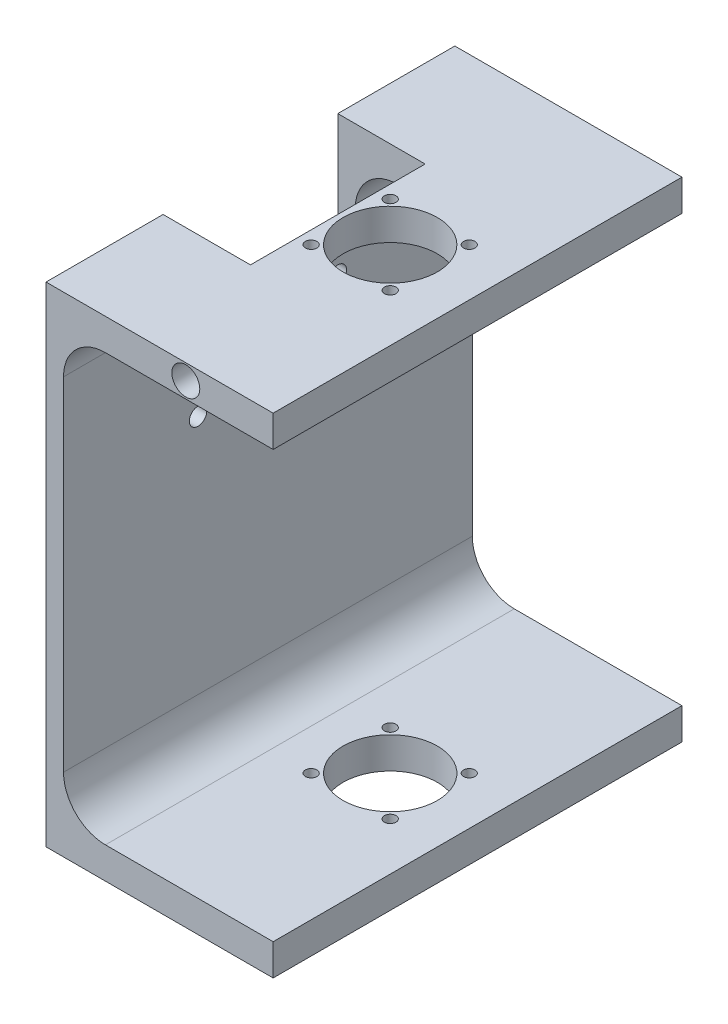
ISO-10303-21;
HEADER;
FILE_DESCRIPTION(('STEP AP214'),'2;1');
FILE_NAME('part.step','',(''),(''),'','','');
FILE_SCHEMA(('AUTOMOTIVE_DESIGN { 1 0 10303 214 1 1 1 1 }'));
ENDSEC;
DATA;
#1=APPLICATION_CONTEXT('core data for automotive mechanical design processes');
#2=APPLICATION_PROTOCOL_DEFINITION('international standard','automotive_design',2000,#1);
#3=PRODUCT_CONTEXT('',#1,'mechanical');
#4=PRODUCT('Part','Part','',(#3));
#5=PRODUCT_RELATED_PRODUCT_CATEGORY('part','',(#4));
#6=PRODUCT_DEFINITION_FORMATION('','',#4);
#7=PRODUCT_DEFINITION_CONTEXT('part definition',#1,'design');
#8=PRODUCT_DEFINITION('design','',#6,#7);
#9=PRODUCT_DEFINITION_SHAPE('','',#8);
#10=(LENGTH_UNIT() NAMED_UNIT(*) SI_UNIT(.MILLI.,.METRE.));
#11=(NAMED_UNIT(*) PLANE_ANGLE_UNIT() SI_UNIT($,.RADIAN.));
#12=(NAMED_UNIT(*) SI_UNIT($,.STERADIAN.) SOLID_ANGLE_UNIT());
#13=UNCERTAINTY_MEASURE_WITH_UNIT(LENGTH_MEASURE(1.E-05),#10,'distance_accuracy_value','');
#14=(GEOMETRIC_REPRESENTATION_CONTEXT(3) GLOBAL_UNCERTAINTY_ASSIGNED_CONTEXT((#13)) GLOBAL_UNIT_ASSIGNED_CONTEXT((#10,
#11,#12)) REPRESENTATION_CONTEXT('',''));
#15=CARTESIAN_POINT('',(0.,0.,0.));
#16=DIRECTION('',(0.,0.,1.));
#17=DIRECTION('',(1.,0.,0.));
#18=AXIS2_PLACEMENT_3D('',#15,#16,#17);
#19=CARTESIAN_POINT('',(17.,48.9999999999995,58.5));
#20=DIRECTION('',(0.,0.,1.));
#21=DIRECTION('',(1.,0.,0.));
#22=AXIS2_PLACEMENT_3D('',#19,#20,#21);
#23=CYLINDRICAL_SURFACE('',#22,12.);
#24=DIRECTION('',(0.,0.,-1.));
#25=VECTOR('',#24,1.);
#26=CARTESIAN_POINT('',(5.00000000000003,49.,58.5));
#27=LINE('',#26,#25);
#28=CARTESIAN_POINT('',(5.,49.,25.));
#29=VERTEX_POINT('',#28);
#30=CARTESIAN_POINT('',(5.00000000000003,49.,58.5));
#31=VERTEX_POINT('',#30);
#32=EDGE_CURVE('E321',#29,#31,#27,.F.);
#33=ORIENTED_EDGE('',*,*,#32,.F.);
#34=CARTESIAN_POINT('',(17.,49.,25.));
#35=DIRECTION('',(0.,0.,1.));
#36=DIRECTION('',(1.,0.,0.));
#37=AXIS2_PLACEMENT_3D('',#34,#35,#36);
#38=CIRCLE('',#37,12.);
#39=CARTESIAN_POINT('',(17.,61.,25.));
#40=VERTEX_POINT('',#39);
#41=EDGE_CURVE('E346',#29,#40,#38,.F.);
#42=ORIENTED_EDGE('',*,*,#41,.T.);
#43=DIRECTION('',(0.,0.,-1.));
#44=VECTOR('',#43,1.);
#45=CARTESIAN_POINT('',(17.,61.,-58.5));
#46=LINE('',#45,#44);
#47=CARTESIAN_POINT('',(17.,61.,58.5));
#48=VERTEX_POINT('',#47);
#49=EDGE_CURVE('E331',#48,#40,#46,.T.);
#50=ORIENTED_EDGE('',*,*,#49,.F.);
#51=CARTESIAN_POINT('',(17.,48.9999999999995,58.5));
#52=DIRECTION('',(0.,0.,-1.));
#53=DIRECTION('',(-1.,0.,0.));
#54=AXIS2_PLACEMENT_3D('',#51,#52,#53);
#55=CIRCLE('',#54,12.);
#56=EDGE_CURVE('E340',#31,#48,#55,.T.);
#57=ORIENTED_EDGE('',*,*,#56,.F.);
#58=EDGE_LOOP('',(#33,#42,#50,#57));
#59=FACE_BOUND('',#58,.T.);
#60=ADVANCED_FACE('F26',(#59),#23,.F.);
#61=CARTESIAN_POINT('',(65.,70.,58.5));
#62=DIRECTION('',(-1.,0.,0.));
#63=DIRECTION('',(0.,0.,1.));
#64=AXIS2_PLACEMENT_3D('',#61,#62,#63);
#65=PLANE('',#64);
#66=DIRECTION('',(0.,1.,0.));
#67=VECTOR('',#66,1.);
#68=CARTESIAN_POINT('',(65.0000000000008,69.9999999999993,-58.5));
#69=LINE('',#68,#67);
#70=CARTESIAN_POINT('',(65.,61.,-58.5));
#71=VERTEX_POINT('',#70);
#72=CARTESIAN_POINT('',(65.0000000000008,69.9999999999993,-58.5));
#73=VERTEX_POINT('',#72);
#74=EDGE_CURVE('E263',#71,#73,#69,.T.);
#75=ORIENTED_EDGE('',*,*,#74,.T.);
#76=DIRECTION('',(0.,0.,-1.));
#77=VECTOR('',#76,1.);
#78=CARTESIAN_POINT('',(65.,70.,58.5));
#79=LINE('',#78,#77);
#80=CARTESIAN_POINT('',(65.,70.,58.5));
#81=VERTEX_POINT('',#80);
#82=EDGE_CURVE('E318',#81,#73,#79,.T.);
#83=ORIENTED_EDGE('',*,*,#82,.F.);
#84=DIRECTION('',(0.,1.,0.));
#85=VECTOR('',#84,1.);
#86=CARTESIAN_POINT('',(65.,70.,58.5));
#87=LINE('',#86,#85);
#88=CARTESIAN_POINT('',(65.,61.,58.5));
#89=VERTEX_POINT('',#88);
#90=EDGE_CURVE('E283',#89,#81,#87,.T.);
#91=ORIENTED_EDGE('',*,*,#90,.F.);
#92=DIRECTION('',(0.,0.,-1.));
#93=VECTOR('',#92,1.);
#94=CARTESIAN_POINT('',(65.,61.,58.5));
#95=LINE('',#94,#93);
#96=EDGE_CURVE('E302',#89,#71,#95,.T.);
#97=ORIENTED_EDGE('',*,*,#96,.T.);
#98=EDGE_LOOP('',(#75,#83,#91,#97));
#99=FACE_BOUND('',#98,.T.);
#100=ADVANCED_FACE('F28',(#99),#65,.F.);
#101=CARTESIAN_POINT('',(65.,70.,58.5));
#102=DIRECTION('',(0.,-1.,0.));
#103=DIRECTION('',(0.,0.,-1.));
#104=AXIS2_PLACEMENT_3D('',#101,#102,#103);
#105=PLANE('',#104);
#106=CARTESIAN_POINT('',(51.3137084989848,70.0000000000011,11.3137084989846));
#107=DIRECTION('',(0.,-1.,0.));
#108=DIRECTION('',(0.,0.,-1.));
#109=AXIS2_PLACEMENT_3D('',#106,#107,#108);
#110=CIRCLE('',#109,1.64999999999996);
#111=CARTESIAN_POINT('',(51.3137084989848,70.0000000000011,9.66370849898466));
#112=VERTEX_POINT('',#111);
#113=EDGE_CURVE('E178',#112,#112,#110,.T.);
#114=ORIENTED_EDGE('',*,*,#113,.T.);
#115=EDGE_LOOP('',(#114));
#116=FACE_BOUND('',#115,.T.);
#117=CARTESIAN_POINT('',(51.3137084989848,70.,-11.3137084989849));
#118=DIRECTION('',(0.,-1.,0.));
#119=DIRECTION('',(0.,0.,-1.));
#120=AXIS2_PLACEMENT_3D('',#117,#118,#119);
#121=CIRCLE('',#120,1.64999999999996);
#122=CARTESIAN_POINT('',(51.3137084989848,70.,-12.9637084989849));
#123=VERTEX_POINT('',#122);
#124=EDGE_CURVE('E188',#123,#123,#121,.T.);
#125=ORIENTED_EDGE('',*,*,#124,.T.);
#126=EDGE_LOOP('',(#125));
#127=FACE_BOUND('',#126,.T.);
#128=CARTESIAN_POINT('',(28.6862915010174,69.9999999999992,-11.3137084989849));
#129=DIRECTION('',(0.,-1.,0.));
#130=DIRECTION('',(0.,0.,-1.));
#131=AXIS2_PLACEMENT_3D('',#128,#129,#130);
#132=CIRCLE('',#131,1.64999999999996);
#133=CARTESIAN_POINT('',(28.6862915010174,69.9999999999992,-12.9637084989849));
#134=VERTEX_POINT('',#133);
#135=EDGE_CURVE('E198',#134,#134,#132,.T.);
#136=ORIENTED_EDGE('',*,*,#135,.T.);
#137=EDGE_LOOP('',(#136));
#138=FACE_BOUND('',#137,.T.);
#139=CARTESIAN_POINT('',(28.6862915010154,70.0000000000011,11.3137084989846));
#140=DIRECTION('',(0.,-1.,0.));
#141=DIRECTION('',(0.,0.,-1.));
#142=AXIS2_PLACEMENT_3D('',#139,#140,#141);
#143=CIRCLE('',#142,1.64999999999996);
#144=CARTESIAN_POINT('',(28.6862915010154,70.0000000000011,9.66370849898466));
#145=VERTEX_POINT('',#144);
#146=EDGE_CURVE('E208',#145,#145,#143,.T.);
#147=ORIENTED_EDGE('',*,*,#146,.T.);
#148=EDGE_LOOP('',(#147));
#149=FACE_BOUND('',#148,.T.);
#150=CARTESIAN_POINT('',(40.,70.,0.));
#151=DIRECTION('',(0.,1.,0.));
#152=DIRECTION('',(-1.,0.,0.));
#153=AXIS2_PLACEMENT_3D('',#150,#151,#152);
#154=CIRCLE('',#153,13.5);
#155=CARTESIAN_POINT('',(26.5,70.,0.));
#156=VERTEX_POINT('',#155);
#157=EDGE_CURVE('E253',#156,#156,#154,.T.);
#158=ORIENTED_EDGE('',*,*,#157,.F.);
#159=EDGE_LOOP('',(#158));
#160=FACE_BOUND('',#159,.T.);
#161=DIRECTION('',(0.,0.,-1.));
#162=VECTOR('',#161,1.);
#163=CARTESIAN_POINT('',(25.,70.,-25.));
#164=LINE('',#163,#162);
#165=CARTESIAN_POINT('',(25.,69.9999999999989,25.));
#166=VERTEX_POINT('',#165);
#167=CARTESIAN_POINT('',(25.,70.,-25.));
#168=VERTEX_POINT('',#167);
#169=EDGE_CURVE('E218',#166,#168,#164,.T.);
#170=ORIENTED_EDGE('',*,*,#169,.F.);
#171=DIRECTION('',(1.,0.,0.));
#172=VECTOR('',#171,1.);
#173=CARTESIAN_POINT('',(25.,69.9999999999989,25.));
#174=LINE('',#173,#172);
#175=CARTESIAN_POINT('',(0.,69.9999999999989,25.));
#176=VERTEX_POINT('',#175);
#177=EDGE_CURVE('E223',#176,#166,#174,.T.);
#178=ORIENTED_EDGE('',*,*,#177,.F.);
#179=DIRECTION('',(0.,0.,-1.));
#180=VECTOR('',#179,1.);
#181=CARTESIAN_POINT('',(0.,70.,58.5));
#182=LINE('',#181,#180);
#183=CARTESIAN_POINT('',(0.,70.,58.5));
#184=VERTEX_POINT('',#183);
#185=EDGE_CURVE('E315',#184,#176,#182,.T.);
#186=ORIENTED_EDGE('',*,*,#185,.F.);
#187=DIRECTION('',(-1.,0.,0.));
#188=VECTOR('',#187,1.);
#189=CARTESIAN_POINT('',(65.,70.,58.5));
#190=LINE('',#189,#188);
#191=EDGE_CURVE('E286',#81,#184,#190,.T.);
#192=ORIENTED_EDGE('',*,*,#191,.F.);
#193=ORIENTED_EDGE('',*,*,#82,.T.);
#194=DIRECTION('',(-1.,0.,0.));
#195=VECTOR('',#194,1.);
#196=CARTESIAN_POINT('',(65.0000000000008,69.9999999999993,-58.5));
#197=LINE('',#196,#195);
#198=CARTESIAN_POINT('',(0.,69.9999999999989,-58.5));
#199=VERTEX_POINT('',#198);
#200=EDGE_CURVE('E266',#73,#199,#197,.T.);
#201=ORIENTED_EDGE('',*,*,#200,.T.);
#202=CARTESIAN_POINT('',(0.,70.,-25.));
#203=VERTEX_POINT('',#202);
#204=EDGE_CURVE('E314',#203,#199,#182,.T.);
#205=ORIENTED_EDGE('',*,*,#204,.F.);
#206=DIRECTION('',(-1.,0.,0.));
#207=VECTOR('',#206,1.);
#208=CARTESIAN_POINT('',(25.,70.,-25.));
#209=LINE('',#208,#207);
#210=EDGE_CURVE('E221',#168,#203,#209,.T.);
#211=ORIENTED_EDGE('',*,*,#210,.F.);
#212=EDGE_LOOP('',(#170,#178,#186,#192,#193,#201,#205,#211));
#213=FACE_BOUND('',#212,.T.);
#214=ADVANCED_FACE('F385',(#116,#127,#138,#149,#160,#213),#105,.F.);
#215=CARTESIAN_POINT('',(0.,70.,58.5));
#216=DIRECTION('',(1.,0.,0.));
#217=DIRECTION('',(0.,0.,-1.));
#218=AXIS2_PLACEMENT_3D('',#215,#216,#217);
#219=PLANE('',#218);
#220=CARTESIAN_POINT('',(0.,20.,-19.9999999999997));
#221=DIRECTION('',(-1.,0.,0.));
#222=DIRECTION('',(0.,0.,1.));
#223=AXIS2_PLACEMENT_3D('',#220,#221,#222);
#224=CIRCLE('',#223,2.5);
#225=CARTESIAN_POINT('',(0.,20.,-17.4999999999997));
#226=VERTEX_POINT('',#225);
#227=EDGE_CURVE('E373',#226,#226,#224,.T.);
#228=ORIENTED_EDGE('',*,*,#227,.F.);
#229=EDGE_LOOP('',(#228));
#230=FACE_BOUND('',#229,.T.);
#231=CARTESIAN_POINT('',(0.,35.,-20.));
#232=DIRECTION('',(-1.,0.,0.));
#233=DIRECTION('',(0.,0.,1.));
#234=AXIS2_PLACEMENT_3D('',#231,#232,#233);
#235=CIRCLE('',#234,2.5);
#236=CARTESIAN_POINT('',(0.,35.,-17.5));
#237=VERTEX_POINT('',#236);
#238=EDGE_CURVE('E364',#237,#237,#235,.T.);
#239=ORIENTED_EDGE('',*,*,#238,.F.);
#240=EDGE_LOOP('',(#239));
#241=FACE_BOUND('',#240,.T.);
#242=CARTESIAN_POINT('',(0.,35.,20.));
#243=DIRECTION('',(-1.,0.,0.));
#244=DIRECTION('',(0.,0.,1.));
#245=AXIS2_PLACEMENT_3D('',#242,#243,#244);
#246=CIRCLE('',#245,2.5);
#247=CARTESIAN_POINT('',(0.,35.,22.5));
#248=VERTEX_POINT('',#247);
#249=EDGE_CURVE('E361',#248,#248,#246,.T.);
#250=ORIENTED_EDGE('',*,*,#249,.F.);
#251=EDGE_LOOP('',(#250));
#252=FACE_BOUND('',#251,.T.);
#253=CARTESIAN_POINT('',(0.,20.,20.0000000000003));
#254=DIRECTION('',(-1.,0.,0.));
#255=DIRECTION('',(0.,0.,1.));
#256=AXIS2_PLACEMENT_3D('',#253,#254,#255);
#257=CIRCLE('',#256,2.5);
#258=CARTESIAN_POINT('',(0.,20.,22.5000000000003));
#259=VERTEX_POINT('',#258);
#260=EDGE_CURVE('E168',#259,#259,#257,.T.);
#261=ORIENTED_EDGE('',*,*,#260,.F.);
#262=EDGE_LOOP('',(#261));
#263=FACE_BOUND('',#262,.T.);
#264=ORIENTED_EDGE('',*,*,#185,.T.);
#265=DIRECTION('',(0.,-1.,0.));
#266=VECTOR('',#265,1.);
#267=CARTESIAN_POINT('',(0.,69.9999999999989,25.));
#268=LINE('',#267,#266);
#269=CARTESIAN_POINT('',(0.,40.,25.0000000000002));
#270=VERTEX_POINT('',#269);
#271=EDGE_CURVE('E247',#176,#270,#268,.T.);
#272=ORIENTED_EDGE('',*,*,#271,.T.);
#273=DIRECTION('',(0.,0.,-1.));
#274=VECTOR('',#273,1.);
#275=CARTESIAN_POINT('',(0.,39.9999999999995,58.5));
#276=LINE('',#275,#274);
#277=CARTESIAN_POINT('',(0.,40.,-24.9999999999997));
#278=VERTEX_POINT('',#277);
#279=EDGE_CURVE('E250',#270,#278,#276,.T.);
#280=ORIENTED_EDGE('',*,*,#279,.T.);
#281=DIRECTION('',(0.,1.,0.));
#282=VECTOR('',#281,1.);
#283=CARTESIAN_POINT('',(0.,70.,-25.));
#284=LINE('',#283,#282);
#285=EDGE_CURVE('E238',#278,#203,#284,.T.);
#286=ORIENTED_EDGE('',*,*,#285,.T.);
#287=ORIENTED_EDGE('',*,*,#204,.T.);
#288=DIRECTION('',(0.,-1.,0.));
#289=VECTOR('',#288,1.);
#290=CARTESIAN_POINT('',(0.,69.9999999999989,-58.5));
#291=LINE('',#290,#289);
#292=CARTESIAN_POINT('',(0.,-70.,-58.5));
#293=VERTEX_POINT('',#292);
#294=EDGE_CURVE('E269',#199,#293,#291,.T.);
#295=ORIENTED_EDGE('',*,*,#294,.T.);
#296=DIRECTION('',(0.,0.,-1.));
#297=VECTOR('',#296,1.);
#298=CARTESIAN_POINT('',(0.,-70.,58.5));
#299=LINE('',#298,#297);
#300=CARTESIAN_POINT('',(0.,-70.,58.5));
#301=VERTEX_POINT('',#300);
#302=EDGE_CURVE('E311',#301,#293,#299,.T.);
#303=ORIENTED_EDGE('',*,*,#302,.F.);
#304=DIRECTION('',(0.,-1.,0.));
#305=VECTOR('',#304,1.);
#306=CARTESIAN_POINT('',(0.,70.,58.5));
#307=LINE('',#306,#305);
#308=EDGE_CURVE('E288',#184,#301,#307,.T.);
#309=ORIENTED_EDGE('',*,*,#308,.F.);
#310=EDGE_LOOP('',(#264,#272,#280,#286,#287,#295,#303,#309));
#311=FACE_BOUND('',#310,.T.);
#312=ADVANCED_FACE('F381',(#230,#241,#252,#263,#311),#219,.F.);
#313=CARTESIAN_POINT('',(65.,-70.,58.5));
#314=DIRECTION('',(0.,1.,0.));
#315=DIRECTION('',(0.,0.,1.));
#316=AXIS2_PLACEMENT_3D('',#313,#314,#315);
#317=PLANE('',#316);
#318=CARTESIAN_POINT('',(51.3137084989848,-70.,11.3137084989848));
#319=DIRECTION('',(0.,-1.,0.));
#320=DIRECTION('',(0.,0.,-1.));
#321=AXIS2_PLACEMENT_3D('',#318,#319,#320);
#322=CIRCLE('',#321,1.64999999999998);
#323=CARTESIAN_POINT('',(51.3137084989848,-70.,9.66370849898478));
#324=VERTEX_POINT('',#323);
#325=EDGE_CURVE('E181',#324,#324,#322,.T.);
#326=ORIENTED_EDGE('',*,*,#325,.F.);
#327=EDGE_LOOP('',(#326));
#328=FACE_BOUND('',#327,.T.);
#329=CARTESIAN_POINT('',(51.3137084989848,-70.,-11.3137084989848));
#330=DIRECTION('',(0.,-1.,0.));
#331=DIRECTION('',(0.,0.,-1.));
#332=AXIS2_PLACEMENT_3D('',#329,#330,#331);
#333=CIRCLE('',#332,1.64999999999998);
#334=CARTESIAN_POINT('',(51.3137084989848,-70.,-12.9637084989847));
#335=VERTEX_POINT('',#334);
#336=EDGE_CURVE('E191',#335,#335,#333,.T.);
#337=ORIENTED_EDGE('',*,*,#336,.F.);
#338=EDGE_LOOP('',(#337));
#339=FACE_BOUND('',#338,.T.);
#340=CARTESIAN_POINT('',(28.6862915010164,-69.9999999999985,-11.3137084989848));
#341=DIRECTION('',(0.,-1.,0.));
#342=DIRECTION('',(0.,0.,-1.));
#343=AXIS2_PLACEMENT_3D('',#340,#341,#342);
#344=CIRCLE('',#343,1.64999999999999);
#345=CARTESIAN_POINT('',(28.6862915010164,-69.9999999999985,-12.9637084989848));
#346=VERTEX_POINT('',#345);
#347=EDGE_CURVE('E201',#346,#346,#344,.T.);
#348=ORIENTED_EDGE('',*,*,#347,.F.);
#349=EDGE_LOOP('',(#348));
#350=FACE_BOUND('',#349,.T.);
#351=CARTESIAN_POINT('',(28.6862915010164,-69.9999999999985,11.3137084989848));
#352=DIRECTION('',(0.,-1.,0.));
#353=DIRECTION('',(0.,0.,-1.));
#354=AXIS2_PLACEMENT_3D('',#351,#352,#353);
#355=CIRCLE('',#354,1.64999999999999);
#356=CARTESIAN_POINT('',(28.6862915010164,-69.9999999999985,9.66370849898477));
#357=VERTEX_POINT('',#356);
#358=EDGE_CURVE('E211',#357,#357,#355,.T.);
#359=ORIENTED_EDGE('',*,*,#358,.F.);
#360=EDGE_LOOP('',(#359));
#361=FACE_BOUND('',#360,.T.);
#362=CARTESIAN_POINT('',(40.,-70.,0.));
#363=DIRECTION('',(0.,1.,0.));
#364=DIRECTION('',(-1.,0.,0.));
#365=AXIS2_PLACEMENT_3D('',#362,#363,#364);
#366=CIRCLE('',#365,13.5);
#367=CARTESIAN_POINT('',(26.5,-70.,0.));
#368=VERTEX_POINT('',#367);
#369=EDGE_CURVE('E256',#368,#368,#366,.T.);
#370=ORIENTED_EDGE('',*,*,#369,.T.);
#371=EDGE_LOOP('',(#370));
#372=FACE_BOUND('',#371,.T.);
#373=DIRECTION('',(1.,0.,0.));
#374=VECTOR('',#373,1.);
#375=CARTESIAN_POINT('',(65.,-70.,-58.5));
#376=LINE('',#375,#374);
#377=CARTESIAN_POINT('',(65.,-70.,-58.5));
#378=VERTEX_POINT('',#377);
#379=EDGE_CURVE('E271',#293,#378,#376,.T.);
#380=ORIENTED_EDGE('',*,*,#379,.T.);
#381=DIRECTION('',(0.,0.,-1.));
#382=VECTOR('',#381,1.);
#383=CARTESIAN_POINT('',(65.,-70.,58.5));
#384=LINE('',#383,#382);
#385=CARTESIAN_POINT('',(65.,-70.,58.5));
#386=VERTEX_POINT('',#385);
#387=EDGE_CURVE('E308',#386,#378,#384,.T.);
#388=ORIENTED_EDGE('',*,*,#387,.F.);
#389=DIRECTION('',(1.,0.,0.));
#390=VECTOR('',#389,1.);
#391=CARTESIAN_POINT('',(65.,-70.,58.5));
#392=LINE('',#391,#390);
#393=EDGE_CURVE('E290',#301,#386,#392,.T.);
#394=ORIENTED_EDGE('',*,*,#393,.F.);
#395=ORIENTED_EDGE('',*,*,#302,.T.);
#396=EDGE_LOOP('',(#380,#388,#394,#395));
#397=FACE_BOUND('',#396,.T.);
#398=ADVANCED_FACE('F384',(#328,#339,#350,#361,#372,#397),#317,.F.);
#399=CARTESIAN_POINT('',(65.,-61.,58.5));
#400=DIRECTION('',(-1.,0.,0.));
#401=DIRECTION('',(0.,0.,1.));
#402=AXIS2_PLACEMENT_3D('',#399,#400,#401);
#403=PLANE('',#402);
#404=DIRECTION('',(0.,1.,0.));
#405=VECTOR('',#404,1.);
#406=CARTESIAN_POINT('',(64.9999999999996,-60.999999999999,-58.5));
#407=LINE('',#406,#405);
#408=CARTESIAN_POINT('',(64.9999999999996,-60.999999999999,-58.5));
#409=VERTEX_POINT('',#408);
#410=EDGE_CURVE('E273',#378,#409,#407,.T.);
#411=ORIENTED_EDGE('',*,*,#410,.T.);
#412=DIRECTION('',(0.,0.,-1.));
#413=VECTOR('',#412,1.);
#414=CARTESIAN_POINT('',(65.,-61.,58.5));
#415=LINE('',#414,#413);
#416=CARTESIAN_POINT('',(65.,-61.,58.5));
#417=VERTEX_POINT('',#416);
#418=EDGE_CURVE('E305',#417,#409,#415,.T.);
#419=ORIENTED_EDGE('',*,*,#418,.F.);
#420=DIRECTION('',(0.,1.,0.));
#421=VECTOR('',#420,1.);
#422=CARTESIAN_POINT('',(65.,-61.,58.5));
#423=LINE('',#422,#421);
#424=EDGE_CURVE('E292',#386,#417,#423,.T.);
#425=ORIENTED_EDGE('',*,*,#424,.F.);
#426=ORIENTED_EDGE('',*,*,#387,.T.);
#427=EDGE_LOOP('',(#411,#419,#425,#426));
#428=FACE_BOUND('',#427,.T.);
#429=ADVANCED_FACE('F454',(#428),#403,.F.);
#430=CARTESIAN_POINT('',(65.,-61.,58.5));
#431=DIRECTION('',(0.,-1.,0.));
#432=DIRECTION('',(1.,0.,0.));
#433=AXIS2_PLACEMENT_3D('',#430,#431,#432);
#434=PLANE('',#433);
#435=CARTESIAN_POINT('',(51.3137084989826,-61.,11.3137084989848));
#436=DIRECTION('',(0.,-1.,0.));
#437=DIRECTION('',(1.,0.,0.));
#438=AXIS2_PLACEMENT_3D('',#435,#436,#437);
#439=CIRCLE('',#438,1.64999999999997);
#440=CARTESIAN_POINT('',(52.9637084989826,-61.,11.3137084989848));
#441=VERTEX_POINT('',#440);
#442=EDGE_CURVE('E185',#441,#441,#439,.T.);
#443=ORIENTED_EDGE('',*,*,#442,.T.);
#444=EDGE_LOOP('',(#443));
#445=FACE_BOUND('',#444,.T.);
#446=CARTESIAN_POINT('',(51.3137084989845,-60.9999999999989,-11.3137084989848));
#447=DIRECTION('',(0.,-1.,0.));
#448=DIRECTION('',(1.,0.,0.));
#449=AXIS2_PLACEMENT_3D('',#446,#447,#448);
#450=CIRCLE('',#449,1.64999999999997);
#451=CARTESIAN_POINT('',(52.9637084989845,-60.9999999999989,-11.3137084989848));
#452=VERTEX_POINT('',#451);
#453=EDGE_CURVE('E195',#452,#452,#450,.T.);
#454=ORIENTED_EDGE('',*,*,#453,.T.);
#455=EDGE_LOOP('',(#454));
#456=FACE_BOUND('',#455,.T.);
#457=CARTESIAN_POINT('',(28.6862915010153,-60.9999999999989,-11.3137084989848));
#458=DIRECTION('',(0.,-1.,0.));
#459=DIRECTION('',(1.,0.,0.));
#460=AXIS2_PLACEMENT_3D('',#457,#458,#459);
#461=CIRCLE('',#460,1.64999999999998);
#462=CARTESIAN_POINT('',(30.3362915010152,-60.9999999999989,-11.3137084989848));
#463=VERTEX_POINT('',#462);
#464=EDGE_CURVE('E205',#463,#463,#461,.T.);
#465=ORIENTED_EDGE('',*,*,#464,.T.);
#466=EDGE_LOOP('',(#465));
#467=FACE_BOUND('',#466,.T.);
#468=CARTESIAN_POINT('',(28.6862915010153,-61.,11.3137084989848));
#469=DIRECTION('',(0.,-1.,0.));
#470=DIRECTION('',(1.,0.,0.));
#471=AXIS2_PLACEMENT_3D('',#468,#469,#470);
#472=CIRCLE('',#471,1.64999999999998);
#473=CARTESIAN_POINT('',(30.3362915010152,-61.,11.3137084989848));
#474=VERTEX_POINT('',#473);
#475=EDGE_CURVE('E215',#474,#474,#472,.T.);
#476=ORIENTED_EDGE('',*,*,#475,.T.);
#477=EDGE_LOOP('',(#476));
#478=FACE_BOUND('',#477,.T.);
#479=CARTESIAN_POINT('',(40.,-61.,0.));
#480=DIRECTION('',(0.,-1.,0.));
#481=DIRECTION('',(1.,0.,0.));
#482=AXIS2_PLACEMENT_3D('',#479,#480,#481);
#483=CIRCLE('',#482,13.5);
#484=CARTESIAN_POINT('',(53.5,-61.,0.));
#485=VERTEX_POINT('',#484);
#486=EDGE_CURVE('E260',#485,#485,#483,.T.);
#487=ORIENTED_EDGE('',*,*,#486,.T.);
#488=EDGE_LOOP('',(#487));
#489=FACE_BOUND('',#488,.T.);
#490=DIRECTION('',(-1.,0.,0.));
#491=VECTOR('',#490,1.);
#492=CARTESIAN_POINT('',(64.9999999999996,-60.999999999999,-58.5));
#493=LINE('',#492,#491);
#494=CARTESIAN_POINT('',(17.,-61.,-58.5));
#495=VERTEX_POINT('',#494);
#496=EDGE_CURVE('E275',#409,#495,#493,.T.);
#497=ORIENTED_EDGE('',*,*,#496,.T.);
#498=DIRECTION('',(0.,0.,-1.));
#499=VECTOR('',#498,1.);
#500=CARTESIAN_POINT('',(17.,-61.,58.5));
#501=LINE('',#500,#499);
#502=CARTESIAN_POINT('',(17.,-61.,58.5));
#503=VERTEX_POINT('',#502);
#504=EDGE_CURVE('E328',#495,#503,#501,.F.);
#505=ORIENTED_EDGE('',*,*,#504,.T.);
#506=DIRECTION('',(-1.,0.,0.));
#507=VECTOR('',#506,1.);
#508=CARTESIAN_POINT('',(65.,-61.,58.5));
#509=LINE('',#508,#507);
#510=EDGE_CURVE('E294',#417,#503,#509,.T.);
#511=ORIENTED_EDGE('',*,*,#510,.F.);
#512=ORIENTED_EDGE('',*,*,#418,.T.);
#513=EDGE_LOOP('',(#497,#505,#511,#512));
#514=FACE_BOUND('',#513,.T.);
#515=ADVANCED_FACE('F452',(#445,#456,#467,#478,#489,#514),#434,.F.);
#516=CARTESIAN_POINT('',(5.00000000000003,61.,58.5));
#517=DIRECTION('',(-1.,0.,0.));
#518=DIRECTION('',(0.,0.,1.));
#519=AXIS2_PLACEMENT_3D('',#516,#517,#518);
#520=PLANE('',#519);
#521=CARTESIAN_POINT('',(5.00000000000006,20.,-19.9999999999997));
#522=DIRECTION('',(-1.,0.,0.));
#523=DIRECTION('',(0.,0.,1.));
#524=AXIS2_PLACEMENT_3D('',#521,#522,#523);
#525=CIRCLE('',#524,2.5);
#526=CARTESIAN_POINT('',(5.00000000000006,20.,-17.4999999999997));
#527=VERTEX_POINT('',#526);
#528=EDGE_CURVE('E30',#527,#527,#525,.T.);
#529=ORIENTED_EDGE('',*,*,#528,.T.);
#530=EDGE_LOOP('',(#529));
#531=FACE_BOUND('',#530,.T.);
#532=CARTESIAN_POINT('',(5.00000000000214,35.,-20.));
#533=DIRECTION('',(-1.,0.,0.));
#534=DIRECTION('',(0.,0.,1.));
#535=AXIS2_PLACEMENT_3D('',#532,#533,#534);
#536=CIRCLE('',#535,2.5);
#537=CARTESIAN_POINT('',(5.00000000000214,35.,-17.5));
#538=VERTEX_POINT('',#537);
#539=EDGE_CURVE('E362',#538,#538,#536,.T.);
#540=ORIENTED_EDGE('',*,*,#539,.T.);
#541=EDGE_LOOP('',(#540));
#542=FACE_BOUND('',#541,.T.);
#543=CARTESIAN_POINT('',(5.00000000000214,35.,20.));
#544=DIRECTION('',(-1.,0.,0.));
#545=DIRECTION('',(0.,0.,1.));
#546=AXIS2_PLACEMENT_3D('',#543,#544,#545);
#547=CIRCLE('',#546,2.5);
#548=CARTESIAN_POINT('',(5.00000000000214,35.,22.5));
#549=VERTEX_POINT('',#548);
#550=EDGE_CURVE('E359',#549,#549,#547,.T.);
#551=ORIENTED_EDGE('',*,*,#550,.T.);
#552=EDGE_LOOP('',(#551));
#553=FACE_BOUND('',#552,.T.);
#554=CARTESIAN_POINT('',(5.00000000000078,19.9999999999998,20.0000000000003));
#555=DIRECTION('',(-1.,0.,0.));
#556=DIRECTION('',(0.,0.,1.));
#557=AXIS2_PLACEMENT_3D('',#554,#555,#556);
#558=CIRCLE('',#557,2.5);
#559=CARTESIAN_POINT('',(5.00000000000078,19.9999999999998,22.5000000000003));
#560=VERTEX_POINT('',#559);
#561=EDGE_CURVE('E162',#560,#560,#558,.T.);
#562=ORIENTED_EDGE('',*,*,#561,.T.);
#563=EDGE_LOOP('',(#562));
#564=FACE_BOUND('',#563,.T.);
#565=DIRECTION('',(0.,0.,1.));
#566=VECTOR('',#565,1.);
#567=CARTESIAN_POINT('',(5.0000000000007,39.9999999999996,58.5));
#568=LINE('',#567,#566);
#569=CARTESIAN_POINT('',(5.00000000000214,40.,-24.9999999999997));
#570=VERTEX_POINT('',#569);
#571=CARTESIAN_POINT('',(5.00000000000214,40.,25.0000000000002));
#572=VERTEX_POINT('',#571);
#573=EDGE_CURVE('E11',#570,#572,#568,.T.);
#574=ORIENTED_EDGE('',*,*,#573,.T.);
#575=DIRECTION('',(0.,1.,0.));
#576=VECTOR('',#575,1.);
#577=CARTESIAN_POINT('',(5.00000000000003,61.,25.));
#578=LINE('',#577,#576);
#579=EDGE_CURVE('E244',#572,#29,#578,.T.);
#580=ORIENTED_EDGE('',*,*,#579,.T.);
#581=ORIENTED_EDGE('',*,*,#32,.T.);
#582=DIRECTION('',(0.,1.,0.));
#583=VECTOR('',#582,1.);
#584=CARTESIAN_POINT('',(5.00000000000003,61.,58.5));
#585=LINE('',#584,#583);
#586=CARTESIAN_POINT('',(5.,-49.,58.5));
#587=VERTEX_POINT('',#586);
#588=EDGE_CURVE('E297',#587,#31,#585,.T.);
#589=ORIENTED_EDGE('',*,*,#588,.F.);
#590=DIRECTION('',(0.,0.,-1.));
#591=VECTOR('',#590,1.);
#592=CARTESIAN_POINT('',(5.,-48.9999999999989,-58.5));
#593=LINE('',#592,#591);
#594=CARTESIAN_POINT('',(5.,-48.9999999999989,-58.5));
#595=VERTEX_POINT('',#594);
#596=EDGE_CURVE('E325',#587,#595,#593,.T.);
#597=ORIENTED_EDGE('',*,*,#596,.T.);
#598=DIRECTION('',(0.,1.,0.));
#599=VECTOR('',#598,1.);
#600=CARTESIAN_POINT('',(5.00000000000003,61.,-58.5));
#601=LINE('',#600,#599);
#602=CARTESIAN_POINT('',(5.00000000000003,49.,-58.5));
#603=VERTEX_POINT('',#602);
#604=EDGE_CURVE('E278',#595,#603,#601,.T.);
#605=ORIENTED_EDGE('',*,*,#604,.T.);
#606=CARTESIAN_POINT('',(5.00000000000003,49.,-25.));
#607=VERTEX_POINT('',#606);
#608=EDGE_CURVE('E322',#603,#607,#27,.F.);
#609=ORIENTED_EDGE('',*,*,#608,.T.);
#610=DIRECTION('',(0.,-1.,0.));
#611=VECTOR('',#610,1.);
#612=CARTESIAN_POINT('',(5.00000000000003,61.,-25.));
#613=LINE('',#612,#611);
#614=EDGE_CURVE('E50',#607,#570,#613,.T.);
#615=ORIENTED_EDGE('',*,*,#614,.T.);
#616=EDGE_LOOP('',(#574,#580,#581,#589,#597,#605,#609,#615));
#617=FACE_BOUND('',#616,.T.);
#618=ADVANCED_FACE('F406',(#531,#542,#553,#564,#617),#520,.F.);
#619=CARTESIAN_POINT('',(65.,61.,58.5));
#620=DIRECTION('',(0.,1.,0.));
#621=DIRECTION('',(-1.,0.,0.));
#622=AXIS2_PLACEMENT_3D('',#619,#620,#621);
#623=PLANE('',#622);
#624=CARTESIAN_POINT('',(51.3137084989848,61.,11.3137084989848));
#625=DIRECTION('',(0.,1.,0.));
#626=DIRECTION('',(-1.,0.,0.));
#627=AXIS2_PLACEMENT_3D('',#624,#625,#626);
#628=CIRCLE('',#627,1.64999999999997);
#629=CARTESIAN_POINT('',(49.6637084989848,61.,11.3137084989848));
#630=VERTEX_POINT('',#629);
#631=EDGE_CURVE('E184',#630,#630,#628,.T.);
#632=ORIENTED_EDGE('',*,*,#631,.T.);
#633=EDGE_LOOP('',(#632));
#634=FACE_BOUND('',#633,.T.);
#635=CARTESIAN_POINT('',(51.3137084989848,61.,-11.3137084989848));
#636=DIRECTION('',(0.,1.,0.));
#637=DIRECTION('',(-1.,0.,0.));
#638=AXIS2_PLACEMENT_3D('',#635,#636,#637);
#639=CIRCLE('',#638,1.64999999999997);
#640=CARTESIAN_POINT('',(49.6637084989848,61.,-11.3137084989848));
#641=VERTEX_POINT('',#640);
#642=EDGE_CURVE('E194',#641,#641,#639,.T.);
#643=ORIENTED_EDGE('',*,*,#642,.T.);
#644=EDGE_LOOP('',(#643));
#645=FACE_BOUND('',#644,.T.);
#646=CARTESIAN_POINT('',(28.6862915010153,61.,-11.3137084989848));
#647=DIRECTION('',(0.,1.,0.));
#648=DIRECTION('',(-1.,0.,0.));
#649=AXIS2_PLACEMENT_3D('',#646,#647,#648);
#650=CIRCLE('',#649,1.64999999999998);
#651=CARTESIAN_POINT('',(27.0362915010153,61.,-11.3137084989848));
#652=VERTEX_POINT('',#651);
#653=EDGE_CURVE('E204',#652,#652,#650,.T.);
#654=ORIENTED_EDGE('',*,*,#653,.T.);
#655=EDGE_LOOP('',(#654));
#656=FACE_BOUND('',#655,.T.);
#657=CARTESIAN_POINT('',(28.6862915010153,61.,11.3137084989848));
#658=DIRECTION('',(0.,1.,0.));
#659=DIRECTION('',(-1.,0.,0.));
#660=AXIS2_PLACEMENT_3D('',#657,#658,#659);
#661=CIRCLE('',#660,1.64999999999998);
#662=CARTESIAN_POINT('',(27.0362915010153,61.,11.3137084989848));
#663=VERTEX_POINT('',#662);
#664=EDGE_CURVE('E214',#663,#663,#661,.T.);
#665=ORIENTED_EDGE('',*,*,#664,.T.);
#666=EDGE_LOOP('',(#665));
#667=FACE_BOUND('',#666,.T.);
#668=CARTESIAN_POINT('',(40.,61.,0.));
#669=DIRECTION('',(0.,1.,0.));
#670=DIRECTION('',(-1.,0.,0.));
#671=AXIS2_PLACEMENT_3D('',#668,#669,#670);
#672=CIRCLE('',#671,13.5);
#673=CARTESIAN_POINT('',(26.5,61.,0.));
#674=VERTEX_POINT('',#673);
#675=EDGE_CURVE('E259',#674,#674,#672,.T.);
#676=ORIENTED_EDGE('',*,*,#675,.T.);
#677=EDGE_LOOP('',(#676));
#678=FACE_BOUND('',#677,.T.);
#679=ORIENTED_EDGE('',*,*,#49,.T.);
#680=DIRECTION('',(1.,0.,0.));
#681=VECTOR('',#680,1.);
#682=CARTESIAN_POINT('',(65.,61.,25.));
#683=LINE('',#682,#681);
#684=CARTESIAN_POINT('',(25.,61.,25.));
#685=VERTEX_POINT('',#684);
#686=EDGE_CURVE('E241',#40,#685,#683,.T.);
#687=ORIENTED_EDGE('',*,*,#686,.T.);
#688=DIRECTION('',(0.,0.,-1.));
#689=VECTOR('',#688,1.);
#690=CARTESIAN_POINT('',(25.,61.,58.5));
#691=LINE('',#690,#689);
#692=CARTESIAN_POINT('',(25.,61.,-25.));
#693=VERTEX_POINT('',#692);
#694=EDGE_CURVE('E35',#685,#693,#691,.T.);
#695=ORIENTED_EDGE('',*,*,#694,.T.);
#696=DIRECTION('',(-1.,0.,0.));
#697=VECTOR('',#696,1.);
#698=CARTESIAN_POINT('',(65.,61.,-25.));
#699=LINE('',#698,#697);
#700=CARTESIAN_POINT('',(17.,61.,-25.));
#701=VERTEX_POINT('',#700);
#702=EDGE_CURVE('E233',#693,#701,#699,.T.);
#703=ORIENTED_EDGE('',*,*,#702,.T.);
#704=CARTESIAN_POINT('',(17.,61.,-58.5));
#705=VERTEX_POINT('',#704);
#706=EDGE_CURVE('E330',#701,#705,#46,.T.);
#707=ORIENTED_EDGE('',*,*,#706,.T.);
#708=DIRECTION('',(1.,0.,0.));
#709=VECTOR('',#708,1.);
#710=CARTESIAN_POINT('',(65.,61.,-58.5));
#711=LINE('',#710,#709);
#712=EDGE_CURVE('E281',#705,#71,#711,.T.);
#713=ORIENTED_EDGE('',*,*,#712,.T.);
#714=ORIENTED_EDGE('',*,*,#96,.F.);
#715=DIRECTION('',(1.,0.,0.));
#716=VECTOR('',#715,1.);
#717=CARTESIAN_POINT('',(65.,61.,58.5));
#718=LINE('',#717,#716);
#719=EDGE_CURVE('E300',#48,#89,#718,.T.);
#720=ORIENTED_EDGE('',*,*,#719,.F.);
#721=EDGE_LOOP('',(#679,#687,#695,#703,#707,#713,#714,#720));
#722=FACE_BOUND('',#721,.T.);
#723=ADVANCED_FACE('F418',(#634,#645,#656,#667,#678,#722),#623,.F.);
#724=CARTESIAN_POINT('',(65.,-70.,58.5));
#725=DIRECTION('',(0.,0.,-1.));
#726=DIRECTION('',(-1.,0.,0.));
#727=AXIS2_PLACEMENT_3D('',#724,#725,#726);
#728=PLANE('',#727);
#729=CARTESIAN_POINT('',(40.,65.5,58.5));
#730=DIRECTION('',(0.,0.,1.));
#731=DIRECTION('',(1.,0.,0.));
#732=AXIS2_PLACEMENT_3D('',#729,#730,#731);
#733=CIRCLE('',#732,4.);
#734=CARTESIAN_POINT('',(44.,65.5,58.5));
#735=VERTEX_POINT('',#734);
#736=EDGE_CURVE('E161',#735,#735,#733,.T.);
#737=ORIENTED_EDGE('',*,*,#736,.F.);
#738=EDGE_LOOP('',(#737));
#739=FACE_BOUND('',#738,.T.);
#740=ORIENTED_EDGE('',*,*,#90,.T.);
#741=ORIENTED_EDGE('',*,*,#191,.T.);
#742=ORIENTED_EDGE('',*,*,#308,.T.);
#743=ORIENTED_EDGE('',*,*,#393,.T.);
#744=ORIENTED_EDGE('',*,*,#424,.T.);
#745=ORIENTED_EDGE('',*,*,#510,.T.);
#746=CARTESIAN_POINT('',(17.,-49.,58.5));
#747=DIRECTION('',(0.,0.,-1.));
#748=DIRECTION('',(-1.,0.,0.));
#749=AXIS2_PLACEMENT_3D('',#746,#747,#748);
#750=CIRCLE('',#749,12.);
#751=EDGE_CURVE('E336',#503,#587,#750,.T.);
#752=ORIENTED_EDGE('',*,*,#751,.T.);
#753=ORIENTED_EDGE('',*,*,#588,.T.);
#754=ORIENTED_EDGE('',*,*,#56,.T.);
#755=ORIENTED_EDGE('',*,*,#719,.T.);
#756=EDGE_LOOP('',(#740,#741,#742,#743,#744,#745,#752,#753,#754,#755));
#757=FACE_BOUND('',#756,.T.);
#758=ADVANCED_FACE('F434',(#739,#757),#728,.F.);
#759=CARTESIAN_POINT('',(65.,-70.,-58.5));
#760=DIRECTION('',(0.,0.,-1.));
#761=DIRECTION('',(-1.,0.,0.));
#762=AXIS2_PLACEMENT_3D('',#759,#760,#761);
#763=PLANE('',#762);
#764=CARTESIAN_POINT('',(40.,65.4999999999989,-58.5));
#765=DIRECTION('',(0.,0.,-1.));
#766=DIRECTION('',(-1.,0.,0.));
#767=AXIS2_PLACEMENT_3D('',#764,#765,#766);
#768=CIRCLE('',#767,4.);
#769=CARTESIAN_POINT('',(36.,65.4999999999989,-58.5));
#770=VERTEX_POINT('',#769);
#771=EDGE_CURVE('E175',#770,#770,#768,.T.);
#772=ORIENTED_EDGE('',*,*,#771,.F.);
#773=EDGE_LOOP('',(#772));
#774=FACE_BOUND('',#773,.T.);
#775=ORIENTED_EDGE('',*,*,#74,.F.);
#776=ORIENTED_EDGE('',*,*,#712,.F.);
#777=CARTESIAN_POINT('',(17.,49.,-58.5));
#778=DIRECTION('',(0.,0.,-1.));
#779=DIRECTION('',(-1.,0.,0.));
#780=AXIS2_PLACEMENT_3D('',#777,#778,#779);
#781=CIRCLE('',#780,12.);
#782=EDGE_CURVE('E338',#705,#603,#781,.F.);
#783=ORIENTED_EDGE('',*,*,#782,.T.);
#784=ORIENTED_EDGE('',*,*,#604,.F.);
#785=CARTESIAN_POINT('',(17.,-48.9999999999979,-58.5));
#786=DIRECTION('',(0.,0.,-1.));
#787=DIRECTION('',(-1.,0.,0.));
#788=AXIS2_PLACEMENT_3D('',#785,#786,#787);
#789=CIRCLE('',#788,12.);
#790=EDGE_CURVE('E334',#595,#495,#789,.F.);
#791=ORIENTED_EDGE('',*,*,#790,.T.);
#792=ORIENTED_EDGE('',*,*,#496,.F.);
#793=ORIENTED_EDGE('',*,*,#410,.F.);
#794=ORIENTED_EDGE('',*,*,#379,.F.);
#795=ORIENTED_EDGE('',*,*,#294,.F.);
#796=ORIENTED_EDGE('',*,*,#200,.F.);
#797=EDGE_LOOP('',(#775,#776,#783,#784,#791,#792,#793,#794,#795,#796));
#798=FACE_BOUND('',#797,.T.);
#799=ADVANCED_FACE('F427',(#774,#798),#763,.T.);
#800=CARTESIAN_POINT('',(17.,-49.,58.5));
#801=DIRECTION('',(0.,0.,1.));
#802=DIRECTION('',(1.,0.,0.));
#803=AXIS2_PLACEMENT_3D('',#800,#801,#802);
#804=CYLINDRICAL_SURFACE('',#803,12.);
#805=ORIENTED_EDGE('',*,*,#751,.F.);
#806=ORIENTED_EDGE('',*,*,#504,.F.);
#807=ORIENTED_EDGE('',*,*,#790,.F.);
#808=ORIENTED_EDGE('',*,*,#596,.F.);
#809=EDGE_LOOP('',(#805,#806,#807,#808));
#810=FACE_BOUND('',#809,.T.);
#811=ADVANCED_FACE('F449',(#810),#804,.F.);
#812=ORIENTED_EDGE('',*,*,#706,.F.);
#813=CARTESIAN_POINT('',(17.,49.,-25.));
#814=DIRECTION('',(0.,0.,-1.));
#815=DIRECTION('',(-1.,0.,0.));
#816=AXIS2_PLACEMENT_3D('',#813,#814,#815);
#817=CIRCLE('',#816,12.);
#818=EDGE_CURVE('E342',#701,#607,#817,.F.);
#819=ORIENTED_EDGE('',*,*,#818,.T.);
#820=ORIENTED_EDGE('',*,*,#608,.F.);
#821=ORIENTED_EDGE('',*,*,#782,.F.);
#822=EDGE_LOOP('',(#812,#819,#820,#821));
#823=FACE_BOUND('',#822,.T.);
#824=ADVANCED_FACE('F413',(#823),#23,.F.);
#825=CARTESIAN_POINT('',(40.,-70.,0.));
#826=DIRECTION('',(0.,1.,0.));
#827=DIRECTION('',(-1.,0.,0.));
#828=AXIS2_PLACEMENT_3D('',#825,#826,#827);
#829=CYLINDRICAL_SURFACE('',#828,13.5);
#830=ORIENTED_EDGE('',*,*,#157,.T.);
#831=EDGE_LOOP('',(#830));
#832=FACE_BOUND('',#831,.T.);
#833=ORIENTED_EDGE('',*,*,#675,.F.);
#834=EDGE_LOOP('',(#833));
#835=FACE_BOUND('',#834,.T.);
#836=ADVANCED_FACE('F475',(#832,#835),#829,.F.);
#837=ORIENTED_EDGE('',*,*,#369,.F.);
#838=EDGE_LOOP('',(#837));
#839=FACE_BOUND('',#838,.T.);
#840=ORIENTED_EDGE('',*,*,#486,.F.);
#841=EDGE_LOOP('',(#840));
#842=FACE_BOUND('',#841,.T.);
#843=ADVANCED_FACE('F480',(#839,#842),#829,.F.);
#844=CARTESIAN_POINT('',(25.0000000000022,40.,25.0000000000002));
#845=DIRECTION('',(0.,-1.,0.));
#846=DIRECTION('',(0.,0.,-1.));
#847=AXIS2_PLACEMENT_3D('',#844,#845,#846);
#848=PLANE('',#847);
#849=DIRECTION('',(1.,0.,0.));
#850=VECTOR('',#849,1.);
#851=CARTESIAN_POINT('',(25.0000000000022,40.,25.0000000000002));
#852=LINE('',#851,#850);
#853=EDGE_CURVE('E227',#270,#572,#852,.T.);
#854=ORIENTED_EDGE('',*,*,#853,.T.);
#855=ORIENTED_EDGE('',*,*,#573,.F.);
#856=DIRECTION('',(-1.,0.,0.));
#857=VECTOR('',#856,1.);
#858=CARTESIAN_POINT('',(25.0000000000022,40.,-24.9999999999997));
#859=LINE('',#858,#857);
#860=EDGE_CURVE('E43',#570,#278,#859,.T.);
#861=ORIENTED_EDGE('',*,*,#860,.T.);
#862=ORIENTED_EDGE('',*,*,#279,.F.);
#863=EDGE_LOOP('',(#854,#855,#861,#862));
#864=FACE_BOUND('',#863,.T.);
#865=ADVANCED_FACE('F404',(#864),#848,.F.);
#866=CARTESIAN_POINT('',(25.0000000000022,40.,-24.9999999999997));
#867=DIRECTION('',(1.,0.,0.));
#868=DIRECTION('',(0.,0.,-1.));
#869=AXIS2_PLACEMENT_3D('',#866,#867,#868);
#870=PLANE('',#869);
#871=DIRECTION('',(0.,1.,0.));
#872=VECTOR('',#871,1.);
#873=CARTESIAN_POINT('',(25.0000000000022,40.,25.0000000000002));
#874=LINE('',#873,#872);
#875=EDGE_CURVE('E231',#685,#166,#874,.T.);
#876=ORIENTED_EDGE('',*,*,#875,.T.);
#877=ORIENTED_EDGE('',*,*,#169,.T.);
#878=DIRECTION('',(0.,1.,0.));
#879=VECTOR('',#878,1.);
#880=CARTESIAN_POINT('',(25.0000000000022,40.,-24.9999999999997));
#881=LINE('',#880,#879);
#882=EDGE_CURVE('E230',#693,#168,#881,.T.);
#883=ORIENTED_EDGE('',*,*,#882,.F.);
#884=ORIENTED_EDGE('',*,*,#694,.F.);
#885=EDGE_LOOP('',(#876,#877,#883,#884));
#886=FACE_BOUND('',#885,.T.);
#887=ADVANCED_FACE('F420',(#886),#870,.F.);
#888=CARTESIAN_POINT('',(25.0000000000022,40.,25.0000000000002));
#889=DIRECTION('',(0.,0.,1.));
#890=DIRECTION('',(1.,0.,0.));
#891=AXIS2_PLACEMENT_3D('',#888,#889,#890);
#892=PLANE('',#891);
#893=ORIENTED_EDGE('',*,*,#177,.T.);
#894=ORIENTED_EDGE('',*,*,#875,.F.);
#895=ORIENTED_EDGE('',*,*,#686,.F.);
#896=ORIENTED_EDGE('',*,*,#41,.F.);
#897=ORIENTED_EDGE('',*,*,#579,.F.);
#898=ORIENTED_EDGE('',*,*,#853,.F.);
#899=ORIENTED_EDGE('',*,*,#271,.F.);
#900=EDGE_LOOP('',(#893,#894,#895,#896,#897,#898,#899));
#901=FACE_BOUND('',#900,.T.);
#902=ADVANCED_FACE('F402',(#901),#892,.F.);
#903=CARTESIAN_POINT('',(25.0000000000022,40.,-24.9999999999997));
#904=DIRECTION('',(0.,0.,-1.));
#905=DIRECTION('',(-1.,0.,0.));
#906=AXIS2_PLACEMENT_3D('',#903,#904,#905);
#907=PLANE('',#906);
#908=ORIENTED_EDGE('',*,*,#860,.F.);
#909=ORIENTED_EDGE('',*,*,#614,.F.);
#910=ORIENTED_EDGE('',*,*,#818,.F.);
#911=ORIENTED_EDGE('',*,*,#702,.F.);
#912=ORIENTED_EDGE('',*,*,#882,.T.);
#913=ORIENTED_EDGE('',*,*,#210,.T.);
#914=ORIENTED_EDGE('',*,*,#285,.F.);
#915=EDGE_LOOP('',(#908,#909,#910,#911,#912,#913,#914));
#916=FACE_BOUND('',#915,.T.);
#917=ADVANCED_FACE('F415',(#916),#907,.F.);
#918=CARTESIAN_POINT('',(28.6862915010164,-69.9999999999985,11.3137084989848));
#919=DIRECTION('',(0.,-1.,0.));
#920=DIRECTION('',(0.,0.,-1.));
#921=AXIS2_PLACEMENT_3D('',#918,#919,#920);
#922=CYLINDRICAL_SURFACE('',#921,1.64999999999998);
#923=ORIENTED_EDGE('',*,*,#146,.F.);
#924=EDGE_LOOP('',(#923));
#925=FACE_BOUND('',#924,.T.);
#926=ORIENTED_EDGE('',*,*,#664,.F.);
#927=EDGE_LOOP('',(#926));
#928=FACE_BOUND('',#927,.T.);
#929=ADVANCED_FACE('F544',(#925,#928),#922,.F.);
#930=ORIENTED_EDGE('',*,*,#358,.T.);
#931=EDGE_LOOP('',(#930));
#932=FACE_BOUND('',#931,.T.);
#933=ORIENTED_EDGE('',*,*,#475,.F.);
#934=EDGE_LOOP('',(#933));
#935=FACE_BOUND('',#934,.T.);
#936=ADVANCED_FACE('F541',(#932,#935),#922,.F.);
#937=CARTESIAN_POINT('',(28.6862915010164,-69.9999999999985,-11.3137084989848));
#938=DIRECTION('',(0.,-1.,0.));
#939=DIRECTION('',(0.,0.,-1.));
#940=AXIS2_PLACEMENT_3D('',#937,#938,#939);
#941=CYLINDRICAL_SURFACE('',#940,1.64999999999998);
#942=ORIENTED_EDGE('',*,*,#135,.F.);
#943=EDGE_LOOP('',(#942));
#944=FACE_BOUND('',#943,.T.);
#945=ORIENTED_EDGE('',*,*,#653,.F.);
#946=EDGE_LOOP('',(#945));
#947=FACE_BOUND('',#946,.T.);
#948=ADVANCED_FACE('F539',(#944,#947),#941,.F.);
#949=ORIENTED_EDGE('',*,*,#347,.T.);
#950=EDGE_LOOP('',(#949));
#951=FACE_BOUND('',#950,.T.);
#952=ORIENTED_EDGE('',*,*,#464,.F.);
#953=EDGE_LOOP('',(#952));
#954=FACE_BOUND('',#953,.T.);
#955=ADVANCED_FACE('F536',(#951,#954),#941,.F.);
#956=CARTESIAN_POINT('',(51.3137084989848,-70.,-11.3137084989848));
#957=DIRECTION('',(0.,-1.,0.));
#958=DIRECTION('',(0.,0.,-1.));
#959=AXIS2_PLACEMENT_3D('',#956,#957,#958);
#960=CYLINDRICAL_SURFACE('',#959,1.64999999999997);
#961=ORIENTED_EDGE('',*,*,#124,.F.);
#962=EDGE_LOOP('',(#961));
#963=FACE_BOUND('',#962,.T.);
#964=ORIENTED_EDGE('',*,*,#642,.F.);
#965=EDGE_LOOP('',(#964));
#966=FACE_BOUND('',#965,.T.);
#967=ADVANCED_FACE('F534',(#963,#966),#960,.F.);
#968=ORIENTED_EDGE('',*,*,#336,.T.);
#969=EDGE_LOOP('',(#968));
#970=FACE_BOUND('',#969,.T.);
#971=ORIENTED_EDGE('',*,*,#453,.F.);
#972=EDGE_LOOP('',(#971));
#973=FACE_BOUND('',#972,.T.);
#974=ADVANCED_FACE('F531',(#970,#973),#960,.F.);
#975=CARTESIAN_POINT('',(51.3137084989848,-70.,11.3137084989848));
#976=DIRECTION('',(0.,-1.,0.));
#977=DIRECTION('',(0.,0.,-1.));
#978=AXIS2_PLACEMENT_3D('',#975,#976,#977);
#979=CYLINDRICAL_SURFACE('',#978,1.64999999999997);
#980=ORIENTED_EDGE('',*,*,#113,.F.);
#981=EDGE_LOOP('',(#980));
#982=FACE_BOUND('',#981,.T.);
#983=ORIENTED_EDGE('',*,*,#631,.F.);
#984=EDGE_LOOP('',(#983));
#985=FACE_BOUND('',#984,.T.);
#986=ADVANCED_FACE('F529',(#982,#985),#979,.F.);
#987=ORIENTED_EDGE('',*,*,#325,.T.);
#988=EDGE_LOOP('',(#987));
#989=FACE_BOUND('',#988,.T.);
#990=ORIENTED_EDGE('',*,*,#442,.F.);
#991=EDGE_LOOP('',(#990));
#992=FACE_BOUND('',#991,.T.);
#993=ADVANCED_FACE('F525',(#989,#992),#979,.F.);
#994=CARTESIAN_POINT('',(40.,65.4999999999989,-58.5));
#995=DIRECTION('',(0.,0.,-1.));
#996=DIRECTION('',(-1.,0.,0.));
#997=AXIS2_PLACEMENT_3D('',#994,#995,#996);
#998=CYLINDRICAL_SURFACE('',#997,4.);
#999=CARTESIAN_POINT('',(40.,65.4999999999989,-40.5));
#1000=DIRECTION('',(0.,0.,-1.));
#1001=DIRECTION('',(-1.,0.,0.));
#1002=AXIS2_PLACEMENT_3D('',#999,#1000,#1001);
#1003=CIRCLE('',#1002,4.);
#1004=CARTESIAN_POINT('',(36.,65.4999999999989,-40.5));
#1005=VERTEX_POINT('',#1004);
#1006=EDGE_CURVE('E165',#1005,#1005,#1003,.T.);
#1007=ORIENTED_EDGE('',*,*,#1006,.F.);
#1008=EDGE_LOOP('',(#1007));
#1009=FACE_BOUND('',#1008,.T.);
#1010=ORIENTED_EDGE('',*,*,#771,.T.);
#1011=EDGE_LOOP('',(#1010));
#1012=FACE_BOUND('',#1011,.T.);
#1013=ADVANCED_FACE('F521',(#1009,#1012),#998,.F.);
#1014=CARTESIAN_POINT('',(40.,65.4999999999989,-40.5));
#1015=DIRECTION('',(0.,0.,-1.));
#1016=DIRECTION('',(-1.,0.,0.));
#1017=AXIS2_PLACEMENT_3D('',#1014,#1015,#1016);
#1018=CONICAL_SURFACE('',#1017,4.,1.02974425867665);
#1019=CARTESIAN_POINT('',(40.,65.4999999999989,-38.0965575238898));
#1020=VERTEX_POINT('',#1019);
#1021=VERTEX_LOOP('',#1020);
#1022=FACE_BOUND('',#1021,.T.);
#1023=ORIENTED_EDGE('',*,*,#1006,.T.);
#1024=EDGE_LOOP('',(#1023));
#1025=FACE_BOUND('',#1024,.T.);
#1026=ADVANCED_FACE('F518',(#1022,#1025),#1018,.F.);
#1027=CARTESIAN_POINT('',(40.,65.5,58.5));
#1028=DIRECTION('',(0.,0.,1.));
#1029=DIRECTION('',(1.,0.,0.));
#1030=AXIS2_PLACEMENT_3D('',#1027,#1028,#1029);
#1031=CYLINDRICAL_SURFACE('',#1030,4.);
#1032=CARTESIAN_POINT('',(40.,65.4999999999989,40.5));
#1033=DIRECTION('',(0.,0.,1.));
#1034=DIRECTION('',(1.,0.,0.));
#1035=AXIS2_PLACEMENT_3D('',#1032,#1033,#1034);
#1036=CIRCLE('',#1035,4.);
#1037=CARTESIAN_POINT('',(44.,65.4999999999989,40.5));
#1038=VERTEX_POINT('',#1037);
#1039=EDGE_CURVE('E159',#1038,#1038,#1036,.T.);
#1040=ORIENTED_EDGE('',*,*,#1039,.F.);
#1041=EDGE_LOOP('',(#1040));
#1042=FACE_BOUND('',#1041,.T.);
#1043=ORIENTED_EDGE('',*,*,#736,.T.);
#1044=EDGE_LOOP('',(#1043));
#1045=FACE_BOUND('',#1044,.T.);
#1046=ADVANCED_FACE('F155',(#1042,#1045),#1031,.F.);
#1047=CARTESIAN_POINT('',(40.,65.4999999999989,40.5));
#1048=DIRECTION('',(0.,0.,1.));
#1049=DIRECTION('',(1.,0.,0.));
#1050=AXIS2_PLACEMENT_3D('',#1047,#1048,#1049);
#1051=CONICAL_SURFACE('',#1050,4.,1.02974425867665);
#1052=CARTESIAN_POINT('',(40.,65.4999999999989,38.0965575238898));
#1053=VERTEX_POINT('',#1052);
#1054=VERTEX_LOOP('',#1053);
#1055=FACE_BOUND('',#1054,.T.);
#1056=ORIENTED_EDGE('',*,*,#1039,.T.);
#1057=EDGE_LOOP('',(#1056));
#1058=FACE_BOUND('',#1057,.T.);
#1059=ADVANCED_FACE('F151',(#1055,#1058),#1051,.F.);
#1060=CARTESIAN_POINT('',(0.,20.,20.0000000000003));
#1061=DIRECTION('',(-1.,0.,0.));
#1062=DIRECTION('',(0.,0.,1.));
#1063=AXIS2_PLACEMENT_3D('',#1060,#1061,#1062);
#1064=CYLINDRICAL_SURFACE('',#1063,2.5);
#1065=ORIENTED_EDGE('',*,*,#260,.T.);
#1066=EDGE_LOOP('',(#1065));
#1067=FACE_BOUND('',#1066,.T.);
#1068=ORIENTED_EDGE('',*,*,#561,.F.);
#1069=EDGE_LOOP('',(#1068));
#1070=FACE_BOUND('',#1069,.T.);
#1071=ADVANCED_FACE('F154',(#1067,#1070),#1064,.F.);
#1072=CARTESIAN_POINT('',(0.,35.,20.));
#1073=DIRECTION('',(-1.,0.,0.));
#1074=DIRECTION('',(0.,0.,1.));
#1075=AXIS2_PLACEMENT_3D('',#1072,#1073,#1074);
#1076=CYLINDRICAL_SURFACE('',#1075,2.5);
#1077=ORIENTED_EDGE('',*,*,#249,.T.);
#1078=EDGE_LOOP('',(#1077));
#1079=FACE_BOUND('',#1078,.T.);
#1080=ORIENTED_EDGE('',*,*,#550,.F.);
#1081=EDGE_LOOP('',(#1080));
#1082=FACE_BOUND('',#1081,.T.);
#1083=ADVANCED_FACE('F505',(#1079,#1082),#1076,.F.);
#1084=CARTESIAN_POINT('',(0.,35.,-20.));
#1085=DIRECTION('',(-1.,0.,0.));
#1086=DIRECTION('',(0.,0.,1.));
#1087=AXIS2_PLACEMENT_3D('',#1084,#1085,#1086);
#1088=CYLINDRICAL_SURFACE('',#1087,2.5);
#1089=ORIENTED_EDGE('',*,*,#238,.T.);
#1090=EDGE_LOOP('',(#1089));
#1091=FACE_BOUND('',#1090,.T.);
#1092=ORIENTED_EDGE('',*,*,#539,.F.);
#1093=EDGE_LOOP('',(#1092));
#1094=FACE_BOUND('',#1093,.T.);
#1095=ADVANCED_FACE('F511',(#1091,#1094),#1088,.F.);
#1096=CARTESIAN_POINT('',(0.,20.,-19.9999999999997));
#1097=DIRECTION('',(-1.,0.,0.));
#1098=DIRECTION('',(0.,0.,1.));
#1099=AXIS2_PLACEMENT_3D('',#1096,#1097,#1098);
#1100=CYLINDRICAL_SURFACE('',#1099,2.5);
#1101=ORIENTED_EDGE('',*,*,#227,.T.);
#1102=EDGE_LOOP('',(#1101));
#1103=FACE_BOUND('',#1102,.T.);
#1104=ORIENTED_EDGE('',*,*,#528,.F.);
#1105=EDGE_LOOP('',(#1104));
#1106=FACE_BOUND('',#1105,.T.);
#1107=ADVANCED_FACE('F378',(#1103,#1106),#1100,.F.);
#1108=CLOSED_SHELL('',(#60,#100,#214,#312,#398,#429,#515,#618,#723,#758,#799,#811,#824,#836,
#843,#865,#887,#902,#917,#929,#936,#948,#955,#967,#974,#986,#993,#1013,#1026,#1046,#1059,#1071,
#1083,#1095,#1107));
#1109=MANIFOLD_SOLID_BREP('B2',#1108);
#1110=ADVANCED_BREP_SHAPE_REPRESENTATION('',(#18,#1109),#14);
#1111=SHAPE_DEFINITION_REPRESENTATION(#9,#1110);
ENDSEC;
END-ISO-10303-21;
